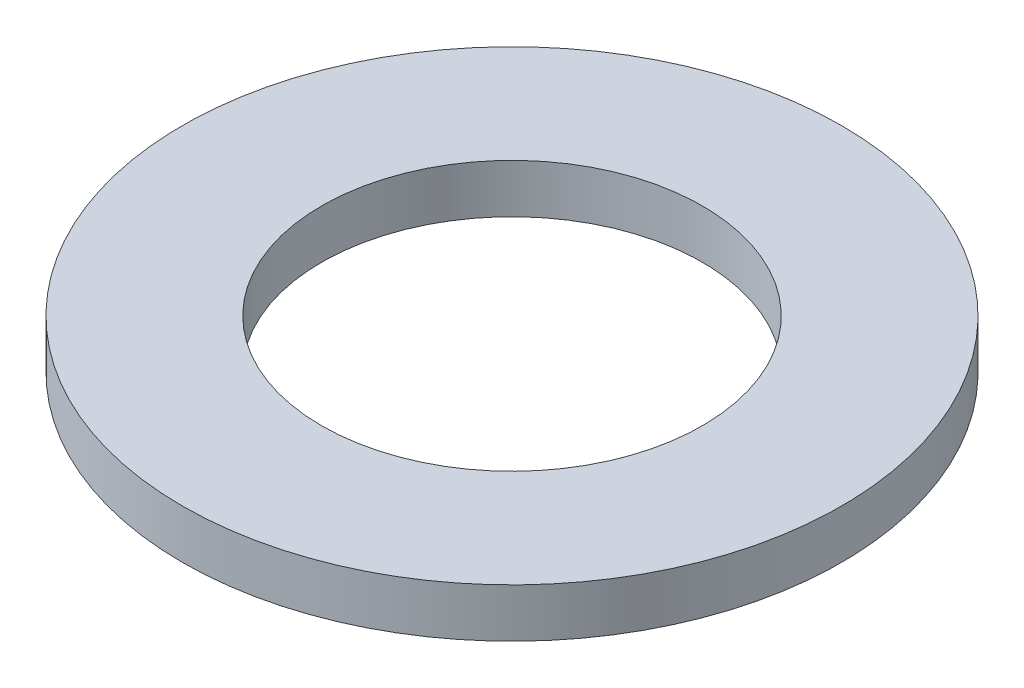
ISO-10303-21;
HEADER;
FILE_DESCRIPTION(('STEP AP214'),'2;1');
FILE_NAME('part.step','',(''),(''),'','','');
FILE_SCHEMA(('AUTOMOTIVE_DESIGN { 1 0 10303 214 1 1 1 1 }'));
ENDSEC;
DATA;
#1=APPLICATION_CONTEXT('core data for automotive mechanical design processes');
#2=APPLICATION_PROTOCOL_DEFINITION('international standard','automotive_design',2000,#1);
#3=PRODUCT_CONTEXT('',#1,'mechanical');
#4=PRODUCT('Part','Part','',(#3));
#5=PRODUCT_RELATED_PRODUCT_CATEGORY('part','',(#4));
#6=PRODUCT_DEFINITION_FORMATION('','',#4);
#7=PRODUCT_DEFINITION_CONTEXT('part definition',#1,'design');
#8=PRODUCT_DEFINITION('design','',#6,#7);
#9=PRODUCT_DEFINITION_SHAPE('','',#8);
#10=(LENGTH_UNIT() NAMED_UNIT(*) SI_UNIT(.MILLI.,.METRE.));
#11=(NAMED_UNIT(*) PLANE_ANGLE_UNIT() SI_UNIT($,.RADIAN.));
#12=(NAMED_UNIT(*) SI_UNIT($,.STERADIAN.) SOLID_ANGLE_UNIT());
#13=UNCERTAINTY_MEASURE_WITH_UNIT(LENGTH_MEASURE(1.E-05),#10,'distance_accuracy_value','');
#14=(GEOMETRIC_REPRESENTATION_CONTEXT(3) GLOBAL_UNCERTAINTY_ASSIGNED_CONTEXT((#13)) GLOBAL_UNIT_ASSIGNED_CONTEXT((#10,
#11,#12)) REPRESENTATION_CONTEXT('',''));
#15=CARTESIAN_POINT('',(0.,0.,0.));
#16=DIRECTION('',(0.,0.,1.));
#17=DIRECTION('',(1.,0.,0.));
#18=AXIS2_PLACEMENT_3D('',#15,#16,#17);
#19=CARTESIAN_POINT('',(0.,10.,0.));
#20=DIRECTION('',(0.,1.,0.));
#21=DIRECTION('',(0.,0.,1.));
#22=AXIS2_PLACEMENT_3D('',#19,#20,#21);
#23=PLANE('',#22);
#24=CARTESIAN_POINT('',(0.,10.,0.));
#25=DIRECTION('',(0.,1.,0.));
#26=DIRECTION('',(0.,0.,1.));
#27=AXIS2_PLACEMENT_3D('',#24,#25,#26);
#28=CIRCLE('',#27,67.5);
#29=CARTESIAN_POINT('',(0.,10.,67.5));
#30=VERTEX_POINT('',#29);
#31=EDGE_CURVE('E10',#30,#30,#28,.T.);
#32=ORIENTED_EDGE('',*,*,#31,.T.);
#33=EDGE_LOOP('',(#32));
#34=FACE_BOUND('',#33,.T.);
#35=CARTESIAN_POINT('',(0.,10.,0.));
#36=DIRECTION('',(0.,1.,0.));
#37=DIRECTION('',(0.,0.,1.));
#38=AXIS2_PLACEMENT_3D('',#35,#36,#37);
#39=CIRCLE('',#38,39.);
#40=CARTESIAN_POINT('',(0.,10.,39.));
#41=VERTEX_POINT('',#40);
#42=EDGE_CURVE('E39',#41,#41,#39,.T.);
#43=ORIENTED_EDGE('',*,*,#42,.F.);
#44=EDGE_LOOP('',(#43));
#45=FACE_BOUND('',#44,.T.);
#46=ADVANCED_FACE('F28',(#34,#45),#23,.T.);
#47=CARTESIAN_POINT('',(0.,0.,0.));
#48=DIRECTION('',(0.,1.,0.));
#49=DIRECTION('',(0.,0.,1.));
#50=AXIS2_PLACEMENT_3D('',#47,#48,#49);
#51=PLANE('',#50);
#52=CARTESIAN_POINT('',(0.,0.,0.));
#53=DIRECTION('',(0.,1.,0.));
#54=DIRECTION('',(0.,0.,1.));
#55=AXIS2_PLACEMENT_3D('',#52,#53,#54);
#56=CIRCLE('',#55,67.5);
#57=CARTESIAN_POINT('',(0.,0.,67.5));
#58=VERTEX_POINT('',#57);
#59=EDGE_CURVE('E35',#58,#58,#56,.T.);
#60=ORIENTED_EDGE('',*,*,#59,.F.);
#61=EDGE_LOOP('',(#60));
#62=FACE_BOUND('',#61,.T.);
#63=CARTESIAN_POINT('',(0.,0.,0.));
#64=DIRECTION('',(0.,1.,0.));
#65=DIRECTION('',(0.,0.,1.));
#66=AXIS2_PLACEMENT_3D('',#63,#64,#65);
#67=CIRCLE('',#66,39.);
#68=CARTESIAN_POINT('',(0.,0.,39.));
#69=VERTEX_POINT('',#68);
#70=EDGE_CURVE('E43',#69,#69,#67,.T.);
#71=ORIENTED_EDGE('',*,*,#70,.T.);
#72=EDGE_LOOP('',(#71));
#73=FACE_BOUND('',#72,.T.);
#74=ADVANCED_FACE('F49',(#62,#73),#51,.F.);
#75=CARTESIAN_POINT('',(0.,10.,0.));
#76=DIRECTION('',(0.,-1.,0.));
#77=DIRECTION('',(0.,0.,-1.));
#78=AXIS2_PLACEMENT_3D('',#75,#76,#77);
#79=CYLINDRICAL_SURFACE('',#78,67.5);
#80=ORIENTED_EDGE('',*,*,#31,.F.);
#81=EDGE_LOOP('',(#80));
#82=FACE_BOUND('',#81,.T.);
#83=ORIENTED_EDGE('',*,*,#59,.T.);
#84=EDGE_LOOP('',(#83));
#85=FACE_BOUND('',#84,.T.);
#86=ADVANCED_FACE('F30',(#82,#85),#79,.T.);
#87=CARTESIAN_POINT('',(0.,10.,0.));
#88=DIRECTION('',(0.,-1.,0.));
#89=DIRECTION('',(0.,0.,-1.));
#90=AXIS2_PLACEMENT_3D('',#87,#88,#89);
#91=CYLINDRICAL_SURFACE('',#90,39.);
#92=ORIENTED_EDGE('',*,*,#42,.T.);
#93=EDGE_LOOP('',(#92));
#94=FACE_BOUND('',#93,.T.);
#95=ORIENTED_EDGE('',*,*,#70,.F.);
#96=EDGE_LOOP('',(#95));
#97=FACE_BOUND('',#96,.T.);
#98=ADVANCED_FACE('F51',(#94,#97),#91,.F.);
#99=CLOSED_SHELL('',(#46,#74,#86,#98));
#100=MANIFOLD_SOLID_BREP('B2',#99);
#101=ADVANCED_BREP_SHAPE_REPRESENTATION('',(#18,#100),#14);
#102=SHAPE_DEFINITION_REPRESENTATION(#9,#101);
ENDSEC;
END-ISO-10303-21;
